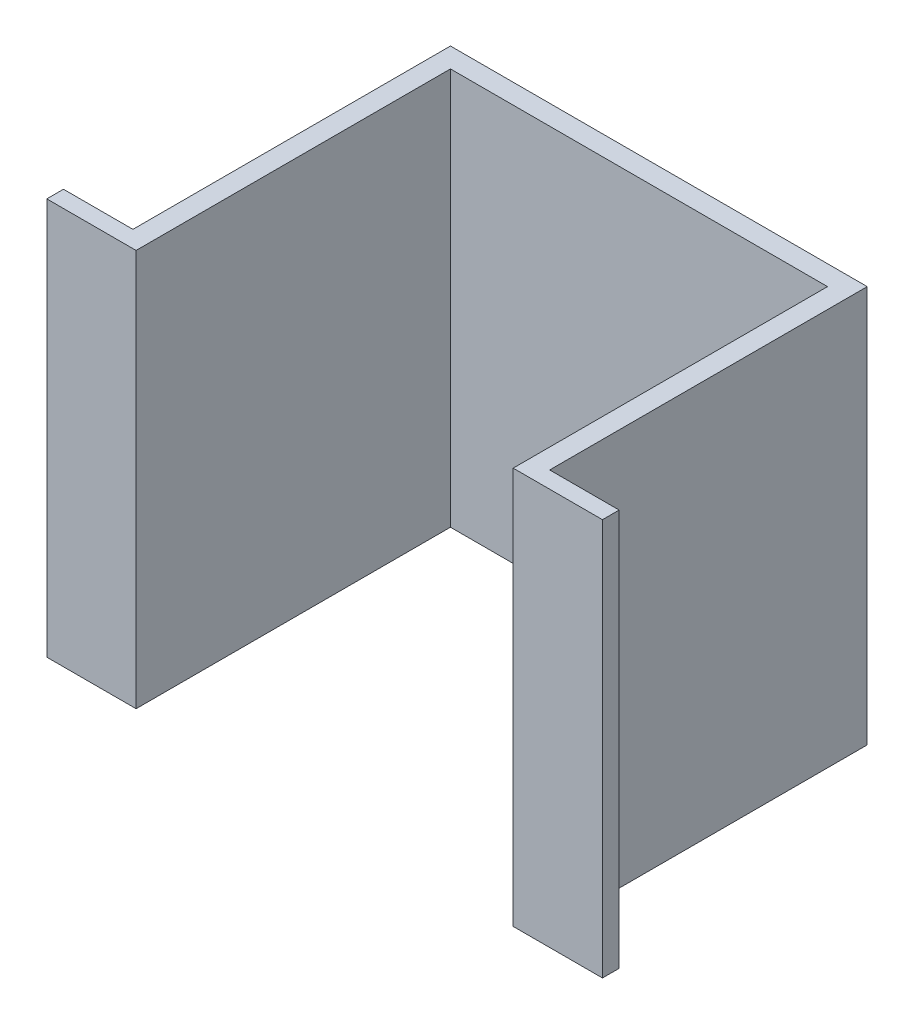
ISO-10303-21;
HEADER;
FILE_DESCRIPTION(('STEP AP214'),'2;1');
FILE_NAME('part.step','',(''),(''),'','','');
FILE_SCHEMA(('AUTOMOTIVE_DESIGN { 1 0 10303 214 1 1 1 1 }'));
ENDSEC;
DATA;
#1=APPLICATION_CONTEXT('core data for automotive mechanical design processes');
#2=APPLICATION_PROTOCOL_DEFINITION('international standard','automotive_design',2000,#1);
#3=PRODUCT_CONTEXT('',#1,'mechanical');
#4=PRODUCT('Part','Part','',(#3));
#5=PRODUCT_RELATED_PRODUCT_CATEGORY('part','',(#4));
#6=PRODUCT_DEFINITION_FORMATION('','',#4);
#7=PRODUCT_DEFINITION_CONTEXT('part definition',#1,'design');
#8=PRODUCT_DEFINITION('design','',#6,#7);
#9=PRODUCT_DEFINITION_SHAPE('','',#8);
#10=(LENGTH_UNIT() NAMED_UNIT(*) SI_UNIT(.MILLI.,.METRE.));
#11=(NAMED_UNIT(*) PLANE_ANGLE_UNIT() SI_UNIT($,.RADIAN.));
#12=(NAMED_UNIT(*) SI_UNIT($,.STERADIAN.) SOLID_ANGLE_UNIT());
#13=UNCERTAINTY_MEASURE_WITH_UNIT(LENGTH_MEASURE(1.E-05),#10,'distance_accuracy_value','');
#14=(GEOMETRIC_REPRESENTATION_CONTEXT(3) GLOBAL_UNCERTAINTY_ASSIGNED_CONTEXT((#13)) GLOBAL_UNIT_ASSIGNED_CONTEXT((#10,
#11,#12)) REPRESENTATION_CONTEXT('',''));
#15=CARTESIAN_POINT('',(0.,0.,0.));
#16=DIRECTION('',(0.,0.,1.));
#17=DIRECTION('',(1.,0.,0.));
#18=AXIS2_PLACEMENT_3D('',#15,#16,#17);
#19=CARTESIAN_POINT('',(21.,20.,2.));
#20=DIRECTION('',(-1.,0.,0.));
#21=DIRECTION('',(0.,-1.,0.));
#22=AXIS2_PLACEMENT_3D('',#19,#20,#21);
#23=PLANE('',#22);
#24=DIRECTION('',(0.,1.,0.));
#25=VECTOR('',#24,1.);
#26=CARTESIAN_POINT('',(21.,20.,0.));
#27=LINE('',#26,#25);
#28=CARTESIAN_POINT('',(21.,-20.,0.));
#29=VERTEX_POINT('',#28);
#30=CARTESIAN_POINT('',(21.,20.,0.));
#31=VERTEX_POINT('',#30);
#32=EDGE_CURVE('E188',#29,#31,#27,.T.);
#33=ORIENTED_EDGE('',*,*,#32,.T.);
#34=DIRECTION('',(0.,0.,-1.));
#35=VECTOR('',#34,1.);
#36=CARTESIAN_POINT('',(21.,20.,2.));
#37=LINE('',#36,#35);
#38=CARTESIAN_POINT('',(21.,20.,32.));
#39=VERTEX_POINT('',#38);
#40=EDGE_CURVE('E11',#39,#31,#37,.T.);
#41=ORIENTED_EDGE('',*,*,#40,.F.);
#42=DIRECTION('',(0.,1.,0.));
#43=VECTOR('',#42,1.);
#44=CARTESIAN_POINT('',(21.,-20.,32.));
#45=LINE('',#44,#43);
#46=CARTESIAN_POINT('',(21.,-20.,32.));
#47=VERTEX_POINT('',#46);
#48=EDGE_CURVE('E138',#47,#39,#45,.T.);
#49=ORIENTED_EDGE('',*,*,#48,.F.);
#50=DIRECTION('',(0.,0.,-1.));
#51=VECTOR('',#50,1.);
#52=CARTESIAN_POINT('',(21.,-20.,2.));
#53=LINE('',#52,#51);
#54=EDGE_CURVE('E199',#47,#29,#53,.T.);
#55=ORIENTED_EDGE('',*,*,#54,.T.);
#56=EDGE_LOOP('',(#33,#41,#49,#55));
#57=FACE_BOUND('',#56,.T.);
#58=ADVANCED_FACE('F37',(#57),#23,.F.);
#59=CARTESIAN_POINT('',(-21.,20.,2.));
#60=DIRECTION('',(0.,-1.,0.));
#61=DIRECTION('',(0.,0.,-1.));
#62=AXIS2_PLACEMENT_3D('',#59,#60,#61);
#63=PLANE('',#62);
#64=DIRECTION('',(-1.,0.,0.));
#65=VECTOR('',#64,1.);
#66=CARTESIAN_POINT('',(-21.,20.,0.));
#67=LINE('',#66,#65);
#68=CARTESIAN_POINT('',(-21.,20.,0.));
#69=VERTEX_POINT('',#68);
#70=EDGE_CURVE('E202',#31,#69,#67,.T.);
#71=ORIENTED_EDGE('',*,*,#70,.T.);
#72=DIRECTION('',(0.,0.,-1.));
#73=VECTOR('',#72,1.);
#74=CARTESIAN_POINT('',(-21.,20.,2.));
#75=LINE('',#74,#73);
#76=CARTESIAN_POINT('',(-21.,20.,32.));
#77=VERTEX_POINT('',#76);
#78=EDGE_CURVE('E44',#77,#69,#75,.T.);
#79=ORIENTED_EDGE('',*,*,#78,.F.);
#80=DIRECTION('',(-1.,0.,0.));
#81=VECTOR('',#80,1.);
#82=CARTESIAN_POINT('',(-21.,20.,32.));
#83=LINE('',#82,#81);
#84=CARTESIAN_POINT('',(-28.,20.,32.));
#85=VERTEX_POINT('',#84);
#86=EDGE_CURVE('E157',#77,#85,#83,.T.);
#87=ORIENTED_EDGE('',*,*,#86,.T.);
#88=DIRECTION('',(0.,0.,1.));
#89=VECTOR('',#88,1.);
#90=CARTESIAN_POINT('',(-28.,20.,32.));
#91=LINE('',#90,#89);
#92=CARTESIAN_POINT('',(-28.,20.,33.6814299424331));
#93=VERTEX_POINT('',#92);
#94=EDGE_CURVE('E181',#85,#93,#91,.T.);
#95=ORIENTED_EDGE('',*,*,#94,.T.);
#96=DIRECTION('',(1.,0.,0.));
#97=VECTOR('',#96,1.);
#98=CARTESIAN_POINT('',(-28.,20.,33.6814299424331));
#99=LINE('',#98,#97);
#100=CARTESIAN_POINT('',(-19.,20.,33.6814299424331));
#101=VERTEX_POINT('',#100);
#102=EDGE_CURVE('E184',#93,#101,#99,.T.);
#103=ORIENTED_EDGE('',*,*,#102,.T.);
#104=DIRECTION('',(0.,0.,-1.));
#105=VECTOR('',#104,1.);
#106=CARTESIAN_POINT('',(-19.,20.,32.));
#107=LINE('',#106,#105);
#108=CARTESIAN_POINT('',(-19.,20.,2.));
#109=VERTEX_POINT('',#108);
#110=EDGE_CURVE('E130',#101,#109,#107,.T.);
#111=ORIENTED_EDGE('',*,*,#110,.T.);
#112=DIRECTION('',(-1.,0.,0.));
#113=VECTOR('',#112,1.);
#114=CARTESIAN_POINT('',(-21.,20.,2.));
#115=LINE('',#114,#113);
#116=CARTESIAN_POINT('',(19.,20.,2.));
#117=VERTEX_POINT('',#116);
#118=EDGE_CURVE('E123',#117,#109,#115,.T.);
#119=ORIENTED_EDGE('',*,*,#118,.F.);
#120=DIRECTION('',(0.,0.,1.));
#121=VECTOR('',#120,1.);
#122=CARTESIAN_POINT('',(19.,20.,2.));
#123=LINE('',#122,#121);
#124=CARTESIAN_POINT('',(19.,20.,33.6814299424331));
#125=VERTEX_POINT('',#124);
#126=EDGE_CURVE('E127',#117,#125,#123,.T.);
#127=ORIENTED_EDGE('',*,*,#126,.T.);
#128=DIRECTION('',(1.,0.,0.));
#129=VECTOR('',#128,1.);
#130=CARTESIAN_POINT('',(28.,20.,33.6814299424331));
#131=LINE('',#130,#129);
#132=CARTESIAN_POINT('',(28.,20.,33.6814299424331));
#133=VERTEX_POINT('',#132);
#134=EDGE_CURVE('E155',#125,#133,#131,.T.);
#135=ORIENTED_EDGE('',*,*,#134,.T.);
#136=DIRECTION('',(0.,0.,-1.));
#137=VECTOR('',#136,1.);
#138=CARTESIAN_POINT('',(28.,20.,32.));
#139=LINE('',#138,#137);
#140=CARTESIAN_POINT('',(28.,20.,32.));
#141=VERTEX_POINT('',#140);
#142=EDGE_CURVE('E147',#133,#141,#139,.T.);
#143=ORIENTED_EDGE('',*,*,#142,.T.);
#144=DIRECTION('',(-1.,0.,0.));
#145=VECTOR('',#144,1.);
#146=CARTESIAN_POINT('',(21.,20.,32.));
#147=LINE('',#146,#145);
#148=EDGE_CURVE('E143',#141,#39,#147,.T.);
#149=ORIENTED_EDGE('',*,*,#148,.T.);
#150=ORIENTED_EDGE('',*,*,#40,.T.);
#151=EDGE_LOOP('',(#71,#79,#87,#95,#103,#111,#119,#127,#135,#143,#149,#150));
#152=FACE_BOUND('',#151,.T.);
#153=ADVANCED_FACE('F124',(#152),#63,.F.);
#154=CARTESIAN_POINT('',(-21.,20.,2.));
#155=DIRECTION('',(1.,0.,0.));
#156=DIRECTION('',(0.,1.,0.));
#157=AXIS2_PLACEMENT_3D('',#154,#155,#156);
#158=PLANE('',#157);
#159=DIRECTION('',(0.,-1.,0.));
#160=VECTOR('',#159,1.);
#161=CARTESIAN_POINT('',(-21.,20.,0.));
#162=LINE('',#161,#160);
#163=CARTESIAN_POINT('',(-21.,-20.,0.));
#164=VERTEX_POINT('',#163);
#165=EDGE_CURVE('E204',#69,#164,#162,.T.);
#166=ORIENTED_EDGE('',*,*,#165,.T.);
#167=DIRECTION('',(0.,0.,-1.));
#168=VECTOR('',#167,1.);
#169=CARTESIAN_POINT('',(-21.,-20.,2.));
#170=LINE('',#169,#168);
#171=CARTESIAN_POINT('',(-21.,-20.,32.));
#172=VERTEX_POINT('',#171);
#173=EDGE_CURVE('E209',#172,#164,#170,.T.);
#174=ORIENTED_EDGE('',*,*,#173,.F.);
#175=DIRECTION('',(0.,1.,0.));
#176=VECTOR('',#175,1.);
#177=CARTESIAN_POINT('',(-21.,-20.,32.));
#178=LINE('',#177,#176);
#179=EDGE_CURVE('E178',#172,#77,#178,.T.);
#180=ORIENTED_EDGE('',*,*,#179,.T.);
#181=ORIENTED_EDGE('',*,*,#78,.T.);
#182=EDGE_LOOP('',(#166,#174,#180,#181));
#183=FACE_BOUND('',#182,.T.);
#184=ADVANCED_FACE('F214',(#183),#158,.F.);
#185=CARTESIAN_POINT('',(-21.,-20.,2.));
#186=DIRECTION('',(0.,1.,0.));
#187=DIRECTION('',(0.,0.,1.));
#188=AXIS2_PLACEMENT_3D('',#185,#186,#187);
#189=PLANE('',#188);
#190=DIRECTION('',(1.,0.,0.));
#191=VECTOR('',#190,1.);
#192=CARTESIAN_POINT('',(-21.,-20.,0.));
#193=LINE('',#192,#191);
#194=EDGE_CURVE('E131',#164,#29,#193,.T.);
#195=ORIENTED_EDGE('',*,*,#194,.T.);
#196=ORIENTED_EDGE('',*,*,#54,.F.);
#197=DIRECTION('',(-1.,0.,0.));
#198=VECTOR('',#197,1.);
#199=CARTESIAN_POINT('',(21.,-20.,32.));
#200=LINE('',#199,#198);
#201=CARTESIAN_POINT('',(28.,-20.,32.));
#202=VERTEX_POINT('',#201);
#203=EDGE_CURVE('E158',#202,#47,#200,.T.);
#204=ORIENTED_EDGE('',*,*,#203,.F.);
#205=DIRECTION('',(0.,0.,-1.));
#206=VECTOR('',#205,1.);
#207=CARTESIAN_POINT('',(28.,-20.,32.));
#208=LINE('',#207,#206);
#209=CARTESIAN_POINT('',(28.,-20.,33.6814299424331));
#210=VERTEX_POINT('',#209);
#211=EDGE_CURVE('E161',#210,#202,#208,.T.);
#212=ORIENTED_EDGE('',*,*,#211,.F.);
#213=DIRECTION('',(1.,0.,0.));
#214=VECTOR('',#213,1.);
#215=CARTESIAN_POINT('',(28.,-20.,33.6814299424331));
#216=LINE('',#215,#214);
#217=CARTESIAN_POINT('',(19.,-20.,33.6814299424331));
#218=VERTEX_POINT('',#217);
#219=EDGE_CURVE('E149',#218,#210,#216,.T.);
#220=ORIENTED_EDGE('',*,*,#219,.F.);
#221=DIRECTION('',(0.,0.,1.));
#222=VECTOR('',#221,1.);
#223=CARTESIAN_POINT('',(19.,-20.,33.6814299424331));
#224=LINE('',#223,#222);
#225=CARTESIAN_POINT('',(19.,-20.,2.));
#226=VERTEX_POINT('',#225);
#227=EDGE_CURVE('E144',#226,#218,#224,.T.);
#228=ORIENTED_EDGE('',*,*,#227,.F.);
#229=DIRECTION('',(1.,0.,0.));
#230=VECTOR('',#229,1.);
#231=CARTESIAN_POINT('',(-21.,-20.,2.));
#232=LINE('',#231,#230);
#233=CARTESIAN_POINT('',(-19.,-20.,2.));
#234=VERTEX_POINT('',#233);
#235=EDGE_CURVE('E51',#234,#226,#232,.T.);
#236=ORIENTED_EDGE('',*,*,#235,.F.);
#237=DIRECTION('',(0.,0.,-1.));
#238=VECTOR('',#237,1.);
#239=CARTESIAN_POINT('',(-19.,-20.,33.6814299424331));
#240=LINE('',#239,#238);
#241=CARTESIAN_POINT('',(-19.,-20.,33.6814299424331));
#242=VERTEX_POINT('',#241);
#243=EDGE_CURVE('E175',#242,#234,#240,.T.);
#244=ORIENTED_EDGE('',*,*,#243,.F.);
#245=DIRECTION('',(1.,0.,0.));
#246=VECTOR('',#245,1.);
#247=CARTESIAN_POINT('',(-28.,-20.,33.6814299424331));
#248=LINE('',#247,#246);
#249=CARTESIAN_POINT('',(-28.,-20.,33.6814299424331));
#250=VERTEX_POINT('',#249);
#251=EDGE_CURVE('E172',#250,#242,#248,.T.);
#252=ORIENTED_EDGE('',*,*,#251,.F.);
#253=DIRECTION('',(0.,0.,1.));
#254=VECTOR('',#253,1.);
#255=CARTESIAN_POINT('',(-28.,-20.,32.));
#256=LINE('',#255,#254);
#257=CARTESIAN_POINT('',(-28.,-20.,32.));
#258=VERTEX_POINT('',#257);
#259=EDGE_CURVE('E169',#258,#250,#256,.T.);
#260=ORIENTED_EDGE('',*,*,#259,.F.);
#261=DIRECTION('',(-1.,0.,0.));
#262=VECTOR('',#261,1.);
#263=CARTESIAN_POINT('',(-21.,-20.,32.));
#264=LINE('',#263,#262);
#265=EDGE_CURVE('E166',#172,#258,#264,.T.);
#266=ORIENTED_EDGE('',*,*,#265,.F.);
#267=ORIENTED_EDGE('',*,*,#173,.T.);
#268=EDGE_LOOP('',(#195,#196,#204,#212,#220,#228,#236,#244,#252,#260,#266,#267));
#269=FACE_BOUND('',#268,.T.);
#270=ADVANCED_FACE('F222',(#269),#189,.F.);
#271=CARTESIAN_POINT('',(0.,0.,2.));
#272=DIRECTION('',(0.,0.,1.));
#273=DIRECTION('',(1.,0.,0.));
#274=AXIS2_PLACEMENT_3D('',#271,#272,#273);
#275=PLANE('',#274);
#276=DIRECTION('',(0.,1.,0.));
#277=VECTOR('',#276,1.);
#278=CARTESIAN_POINT('',(19.,-20.,2.));
#279=LINE('',#278,#277);
#280=EDGE_CURVE('E134',#226,#117,#279,.T.);
#281=ORIENTED_EDGE('',*,*,#280,.T.);
#282=ORIENTED_EDGE('',*,*,#118,.T.);
#283=DIRECTION('',(0.,1.,0.));
#284=VECTOR('',#283,1.);
#285=CARTESIAN_POINT('',(-19.,-20.,2.));
#286=LINE('',#285,#284);
#287=EDGE_CURVE('E56',#234,#109,#286,.T.);
#288=ORIENTED_EDGE('',*,*,#287,.F.);
#289=ORIENTED_EDGE('',*,*,#235,.T.);
#290=EDGE_LOOP('',(#281,#282,#288,#289));
#291=FACE_BOUND('',#290,.T.);
#292=ADVANCED_FACE('F135',(#291),#275,.T.);
#293=CARTESIAN_POINT('',(0.,0.,0.));
#294=DIRECTION('',(0.,0.,1.));
#295=DIRECTION('',(1.,0.,0.));
#296=AXIS2_PLACEMENT_3D('',#293,#294,#295);
#297=PLANE('',#296);
#298=ORIENTED_EDGE('',*,*,#32,.F.);
#299=ORIENTED_EDGE('',*,*,#194,.F.);
#300=ORIENTED_EDGE('',*,*,#165,.F.);
#301=ORIENTED_EDGE('',*,*,#70,.F.);
#302=EDGE_LOOP('',(#298,#299,#300,#301));
#303=FACE_BOUND('',#302,.T.);
#304=ADVANCED_FACE('F220',(#303),#297,.F.);
#305=CARTESIAN_POINT('',(-19.,-20.,32.));
#306=DIRECTION('',(1.,0.,0.));
#307=DIRECTION('',(0.,0.,-1.));
#308=AXIS2_PLACEMENT_3D('',#305,#306,#307);
#309=PLANE('',#308);
#310=ORIENTED_EDGE('',*,*,#110,.F.);
#311=DIRECTION('',(0.,1.,0.));
#312=VECTOR('',#311,1.);
#313=CARTESIAN_POINT('',(-19.,-20.,33.6814299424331));
#314=LINE('',#313,#312);
#315=EDGE_CURVE('E189',#242,#101,#314,.T.);
#316=ORIENTED_EDGE('',*,*,#315,.F.);
#317=ORIENTED_EDGE('',*,*,#243,.T.);
#318=ORIENTED_EDGE('',*,*,#287,.T.);
#319=EDGE_LOOP('',(#310,#316,#317,#318));
#320=FACE_BOUND('',#319,.T.);
#321=ADVANCED_FACE('F246',(#320),#309,.T.);
#322=CARTESIAN_POINT('',(-28.,-20.,33.6814299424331));
#323=DIRECTION('',(0.,0.,1.));
#324=DIRECTION('',(1.,0.,0.));
#325=AXIS2_PLACEMENT_3D('',#322,#323,#324);
#326=PLANE('',#325);
#327=ORIENTED_EDGE('',*,*,#102,.F.);
#328=DIRECTION('',(0.,1.,0.));
#329=VECTOR('',#328,1.);
#330=CARTESIAN_POINT('',(-28.,-20.,33.6814299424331));
#331=LINE('',#330,#329);
#332=EDGE_CURVE('E192',#250,#93,#331,.T.);
#333=ORIENTED_EDGE('',*,*,#332,.F.);
#334=ORIENTED_EDGE('',*,*,#251,.T.);
#335=ORIENTED_EDGE('',*,*,#315,.T.);
#336=EDGE_LOOP('',(#327,#333,#334,#335));
#337=FACE_BOUND('',#336,.T.);
#338=ADVANCED_FACE('F249',(#337),#326,.T.);
#339=CARTESIAN_POINT('',(-28.,-20.,32.));
#340=DIRECTION('',(-1.,0.,0.));
#341=DIRECTION('',(0.,0.,1.));
#342=AXIS2_PLACEMENT_3D('',#339,#340,#341);
#343=PLANE('',#342);
#344=ORIENTED_EDGE('',*,*,#94,.F.);
#345=DIRECTION('',(0.,1.,0.));
#346=VECTOR('',#345,1.);
#347=CARTESIAN_POINT('',(-28.,-20.,32.));
#348=LINE('',#347,#346);
#349=EDGE_CURVE('E194',#258,#85,#348,.T.);
#350=ORIENTED_EDGE('',*,*,#349,.F.);
#351=ORIENTED_EDGE('',*,*,#259,.T.);
#352=ORIENTED_EDGE('',*,*,#332,.T.);
#353=EDGE_LOOP('',(#344,#350,#351,#352));
#354=FACE_BOUND('',#353,.T.);
#355=ADVANCED_FACE('F252',(#354),#343,.T.);
#356=CARTESIAN_POINT('',(-21.,-20.,32.));
#357=DIRECTION('',(0.,0.,-1.));
#358=DIRECTION('',(-1.,0.,0.));
#359=AXIS2_PLACEMENT_3D('',#356,#357,#358);
#360=PLANE('',#359);
#361=ORIENTED_EDGE('',*,*,#86,.F.);
#362=ORIENTED_EDGE('',*,*,#179,.F.);
#363=ORIENTED_EDGE('',*,*,#265,.T.);
#364=ORIENTED_EDGE('',*,*,#349,.T.);
#365=EDGE_LOOP('',(#361,#362,#363,#364));
#366=FACE_BOUND('',#365,.T.);
#367=ADVANCED_FACE('F255',(#366),#360,.T.);
#368=CARTESIAN_POINT('',(19.,-20.,2.));
#369=DIRECTION('',(-1.,0.,0.));
#370=DIRECTION('',(0.,0.,1.));
#371=AXIS2_PLACEMENT_3D('',#368,#369,#370);
#372=PLANE('',#371);
#373=ORIENTED_EDGE('',*,*,#126,.F.);
#374=ORIENTED_EDGE('',*,*,#280,.F.);
#375=ORIENTED_EDGE('',*,*,#227,.T.);
#376=DIRECTION('',(0.,1.,0.));
#377=VECTOR('',#376,1.);
#378=CARTESIAN_POINT('',(19.,-20.,33.6814299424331));
#379=LINE('',#378,#377);
#380=EDGE_CURVE('E141',#218,#125,#379,.T.);
#381=ORIENTED_EDGE('',*,*,#380,.T.);
#382=EDGE_LOOP('',(#373,#374,#375,#381));
#383=FACE_BOUND('',#382,.T.);
#384=ADVANCED_FACE('F140',(#383),#372,.T.);
#385=CARTESIAN_POINT('',(21.,-20.,32.));
#386=DIRECTION('',(0.,0.,-1.));
#387=DIRECTION('',(-1.,0.,0.));
#388=AXIS2_PLACEMENT_3D('',#385,#386,#387);
#389=PLANE('',#388);
#390=ORIENTED_EDGE('',*,*,#148,.F.);
#391=DIRECTION('',(0.,1.,0.));
#392=VECTOR('',#391,1.);
#393=CARTESIAN_POINT('',(28.,-20.,32.));
#394=LINE('',#393,#392);
#395=EDGE_CURVE('E230',#202,#141,#394,.T.);
#396=ORIENTED_EDGE('',*,*,#395,.F.);
#397=ORIENTED_EDGE('',*,*,#203,.T.);
#398=ORIENTED_EDGE('',*,*,#48,.T.);
#399=EDGE_LOOP('',(#390,#396,#397,#398));
#400=FACE_BOUND('',#399,.T.);
#401=ADVANCED_FACE('F231',(#400),#389,.T.);
#402=CARTESIAN_POINT('',(28.,-20.,32.));
#403=DIRECTION('',(1.,0.,0.));
#404=DIRECTION('',(0.,0.,-1.));
#405=AXIS2_PLACEMENT_3D('',#402,#403,#404);
#406=PLANE('',#405);
#407=ORIENTED_EDGE('',*,*,#142,.F.);
#408=DIRECTION('',(0.,1.,0.));
#409=VECTOR('',#408,1.);
#410=CARTESIAN_POINT('',(28.,-20.,33.6814299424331));
#411=LINE('',#410,#409);
#412=EDGE_CURVE('E237',#210,#133,#411,.T.);
#413=ORIENTED_EDGE('',*,*,#412,.F.);
#414=ORIENTED_EDGE('',*,*,#211,.T.);
#415=ORIENTED_EDGE('',*,*,#395,.T.);
#416=EDGE_LOOP('',(#407,#413,#414,#415));
#417=FACE_BOUND('',#416,.T.);
#418=ADVANCED_FACE('F236',(#417),#406,.T.);
#419=CARTESIAN_POINT('',(28.,-20.,33.6814299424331));
#420=DIRECTION('',(0.,0.,1.));
#421=DIRECTION('',(1.,0.,0.));
#422=AXIS2_PLACEMENT_3D('',#419,#420,#421);
#423=PLANE('',#422);
#424=ORIENTED_EDGE('',*,*,#134,.F.);
#425=ORIENTED_EDGE('',*,*,#380,.F.);
#426=ORIENTED_EDGE('',*,*,#219,.T.);
#427=ORIENTED_EDGE('',*,*,#412,.T.);
#428=EDGE_LOOP('',(#424,#425,#426,#427));
#429=FACE_BOUND('',#428,.T.);
#430=ADVANCED_FACE('F242',(#429),#423,.T.);
#431=CLOSED_SHELL('',(#58,#153,#184,#270,#292,#304,#321,#338,#355,#367,#384,#401,#418,#430));
#432=MANIFOLD_SOLID_BREP('B2',#431);
#433=ADVANCED_BREP_SHAPE_REPRESENTATION('',(#18,#432),#14);
#434=SHAPE_DEFINITION_REPRESENTATION(#9,#433);
ENDSEC;
END-ISO-10303-21;
